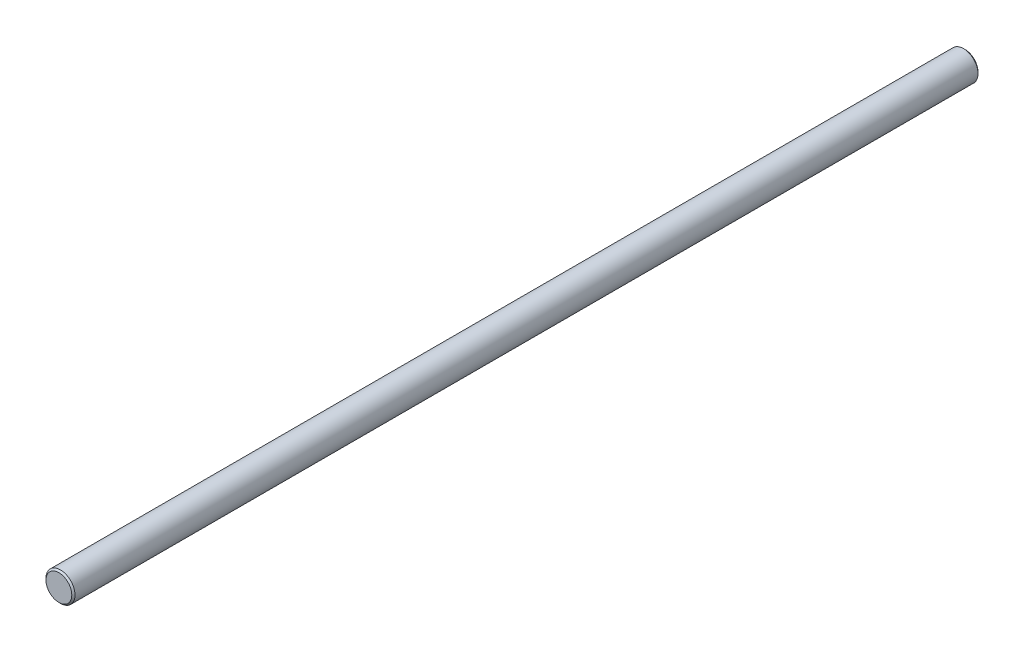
ISO-10303-21;
HEADER;
FILE_DESCRIPTION(('STEP AP214'),'2;1');
FILE_NAME('part.step','',(''),(''),'','','');
FILE_SCHEMA(('AUTOMOTIVE_DESIGN { 1 0 10303 214 1 1 1 1 }'));
ENDSEC;
DATA;
#1=APPLICATION_CONTEXT('core data for automotive mechanical design processes');
#2=APPLICATION_PROTOCOL_DEFINITION('international standard','automotive_design',2000,#1);
#3=PRODUCT_CONTEXT('',#1,'mechanical');
#4=PRODUCT('Part','Part','',(#3));
#5=PRODUCT_RELATED_PRODUCT_CATEGORY('part','',(#4));
#6=PRODUCT_DEFINITION_FORMATION('','',#4);
#7=PRODUCT_DEFINITION_CONTEXT('part definition',#1,'design');
#8=PRODUCT_DEFINITION('design','',#6,#7);
#9=PRODUCT_DEFINITION_SHAPE('','',#8);
#10=(LENGTH_UNIT() NAMED_UNIT(*) SI_UNIT(.MILLI.,.METRE.));
#11=(NAMED_UNIT(*) PLANE_ANGLE_UNIT() SI_UNIT($,.RADIAN.));
#12=(NAMED_UNIT(*) SI_UNIT($,.STERADIAN.) SOLID_ANGLE_UNIT());
#13=UNCERTAINTY_MEASURE_WITH_UNIT(LENGTH_MEASURE(1.E-05),#10,'distance_accuracy_value','');
#14=(GEOMETRIC_REPRESENTATION_CONTEXT(3) GLOBAL_UNCERTAINTY_ASSIGNED_CONTEXT((#13)) GLOBAL_UNIT_ASSIGNED_CONTEXT((#10,
#11,#12)) REPRESENTATION_CONTEXT('',''));
#15=CARTESIAN_POINT('',(0.,0.,0.));
#16=DIRECTION('',(0.,0.,1.));
#17=DIRECTION('',(1.,0.,0.));
#18=AXIS2_PLACEMENT_3D('',#15,#16,#17);
#19=CARTESIAN_POINT('',(0.,0.,140.5));
#20=DIRECTION('',(0.,0.,-1.));
#21=DIRECTION('',(-1.,0.,0.));
#22=AXIS2_PLACEMENT_3D('',#19,#20,#21);
#23=CYLINDRICAL_SURFACE('',#22,4.5);
#24=CARTESIAN_POINT('',(0.,0.,-140.));
#25=DIRECTION('',(0.,0.,1.));
#26=DIRECTION('',(1.,0.,0.));
#27=AXIS2_PLACEMENT_3D('',#24,#25,#26);
#28=CIRCLE('',#27,4.5);
#29=CARTESIAN_POINT('',(4.5,0.,-140.));
#30=VERTEX_POINT('',#29);
#31=EDGE_CURVE('E39',#30,#30,#28,.T.);
#32=ORIENTED_EDGE('',*,*,#31,.T.);
#33=EDGE_LOOP('',(#32));
#34=FACE_BOUND('',#33,.T.);
#35=CARTESIAN_POINT('',(0.,0.,140.));
#36=DIRECTION('',(0.,0.,1.));
#37=DIRECTION('',(1.,0.,0.));
#38=AXIS2_PLACEMENT_3D('',#35,#36,#37);
#39=CIRCLE('',#38,4.5);
#40=CARTESIAN_POINT('',(4.5,0.,140.));
#41=VERTEX_POINT('',#40);
#42=EDGE_CURVE('E43',#41,#41,#39,.F.);
#43=ORIENTED_EDGE('',*,*,#42,.T.);
#44=EDGE_LOOP('',(#43));
#45=FACE_BOUND('',#44,.T.);
#46=ADVANCED_FACE('F28',(#34,#45),#23,.T.);
#47=CARTESIAN_POINT('',(0.,0.,140.5));
#48=DIRECTION('',(0.,0.,1.));
#49=DIRECTION('',(1.,0.,0.));
#50=AXIS2_PLACEMENT_3D('',#47,#48,#49);
#51=PLANE('',#50);
#52=CARTESIAN_POINT('',(0.,0.,140.5));
#53=DIRECTION('',(0.,0.,1.));
#54=DIRECTION('',(1.,0.,0.));
#55=AXIS2_PLACEMENT_3D('',#52,#53,#54);
#56=CIRCLE('',#55,3.99999999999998);
#57=CARTESIAN_POINT('',(3.99999999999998,0.,140.5));
#58=VERTEX_POINT('',#57);
#59=EDGE_CURVE('E10',#58,#58,#56,.T.);
#60=ORIENTED_EDGE('',*,*,#59,.T.);
#61=EDGE_LOOP('',(#60));
#62=FACE_BOUND('',#61,.T.);
#63=ADVANCED_FACE('F59',(#62),#51,.T.);
#64=CARTESIAN_POINT('',(0.,0.,-140.5));
#65=DIRECTION('',(0.,0.,1.));
#66=DIRECTION('',(1.,0.,0.));
#67=AXIS2_PLACEMENT_3D('',#64,#65,#66);
#68=PLANE('',#67);
#69=CARTESIAN_POINT('',(0.,0.,-140.5));
#70=DIRECTION('',(0.,0.,1.));
#71=DIRECTION('',(1.,0.,0.));
#72=AXIS2_PLACEMENT_3D('',#69,#70,#71);
#73=CIRCLE('',#72,3.99999999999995);
#74=CARTESIAN_POINT('',(3.99999999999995,0.,-140.5));
#75=VERTEX_POINT('',#74);
#76=EDGE_CURVE('E35',#75,#75,#73,.F.);
#77=ORIENTED_EDGE('',*,*,#76,.T.);
#78=EDGE_LOOP('',(#77));
#79=FACE_BOUND('',#78,.T.);
#80=ADVANCED_FACE('F56',(#79),#68,.F.);
#81=CARTESIAN_POINT('',(0.,0.,-140.));
#82=DIRECTION('',(0.,0.,1.));
#83=DIRECTION('',(1.,0.,0.));
#84=AXIS2_PLACEMENT_3D('',#81,#82,#83);
#85=CONICAL_SURFACE('',#84,4.5,0.785398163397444);
#86=ORIENTED_EDGE('',*,*,#76,.F.);
#87=EDGE_LOOP('',(#86));
#88=FACE_BOUND('',#87,.T.);
#89=ORIENTED_EDGE('',*,*,#31,.F.);
#90=EDGE_LOOP('',(#89));
#91=FACE_BOUND('',#90,.T.);
#92=ADVANCED_FACE('F52',(#88,#91),#85,.T.);
#93=CARTESIAN_POINT('',(0.,0.,140.5));
#94=DIRECTION('',(0.,0.,-1.));
#95=DIRECTION('',(-1.,0.,0.));
#96=AXIS2_PLACEMENT_3D('',#93,#94,#95);
#97=CONICAL_SURFACE('',#96,3.99999999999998,0.785398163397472);
#98=ORIENTED_EDGE('',*,*,#42,.F.);
#99=EDGE_LOOP('',(#98));
#100=FACE_BOUND('',#99,.T.);
#101=ORIENTED_EDGE('',*,*,#59,.F.);
#102=EDGE_LOOP('',(#101));
#103=FACE_BOUND('',#102,.T.);
#104=ADVANCED_FACE('F30',(#100,#103),#97,.T.);
#105=CLOSED_SHELL('',(#46,#63,#80,#92,#104));
#106=MANIFOLD_SOLID_BREP('B2',#105);
#107=ADVANCED_BREP_SHAPE_REPRESENTATION('',(#18,#106),#14);
#108=SHAPE_DEFINITION_REPRESENTATION(#9,#107);
ENDSEC;
END-ISO-10303-21;
